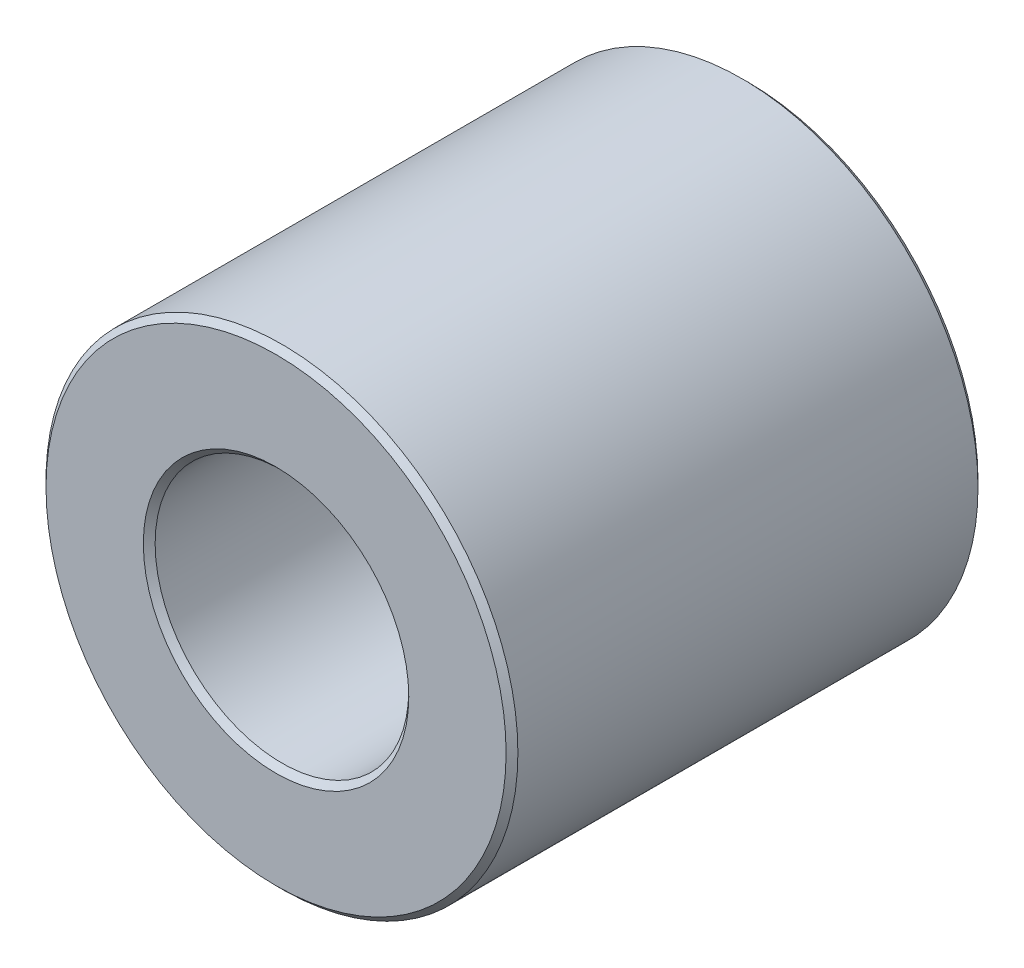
ISO-10303-21;
HEADER;
FILE_DESCRIPTION(('STEP AP214'),'2;1');
FILE_NAME('part.step','',(''),(''),'','','');
FILE_SCHEMA(('AUTOMOTIVE_DESIGN { 1 0 10303 214 1 1 1 1 }'));
ENDSEC;
DATA;
#1=APPLICATION_CONTEXT('core data for automotive mechanical design processes');
#2=APPLICATION_PROTOCOL_DEFINITION('international standard','automotive_design',2000,#1);
#3=PRODUCT_CONTEXT('',#1,'mechanical');
#4=PRODUCT('Part','Part','',(#3));
#5=PRODUCT_RELATED_PRODUCT_CATEGORY('part','',(#4));
#6=PRODUCT_DEFINITION_FORMATION('','',#4);
#7=PRODUCT_DEFINITION_CONTEXT('part definition',#1,'design');
#8=PRODUCT_DEFINITION('design','',#6,#7);
#9=PRODUCT_DEFINITION_SHAPE('','',#8);
#10=(LENGTH_UNIT() NAMED_UNIT(*) SI_UNIT(.MILLI.,.METRE.));
#11=(NAMED_UNIT(*) PLANE_ANGLE_UNIT() SI_UNIT($,.RADIAN.));
#12=(NAMED_UNIT(*) SI_UNIT($,.STERADIAN.) SOLID_ANGLE_UNIT());
#13=UNCERTAINTY_MEASURE_WITH_UNIT(LENGTH_MEASURE(1.E-05),#10,'distance_accuracy_value','');
#14=(GEOMETRIC_REPRESENTATION_CONTEXT(3) GLOBAL_UNCERTAINTY_ASSIGNED_CONTEXT((#13)) GLOBAL_UNIT_ASSIGNED_CONTEXT((#10,
#11,#12)) REPRESENTATION_CONTEXT('',''));
#15=CARTESIAN_POINT('',(0.,0.,0.));
#16=DIRECTION('',(0.,0.,1.));
#17=DIRECTION('',(1.,0.,0.));
#18=AXIS2_PLACEMENT_3D('',#15,#16,#17);
#19=CARTESIAN_POINT('',(0.,0.,4.));
#20=DIRECTION('',(0.,0.,1.));
#21=DIRECTION('',(1.,0.,0.));
#22=AXIS2_PLACEMENT_3D('',#19,#20,#21);
#23=PLANE('',#22);
#24=CARTESIAN_POINT('',(0.,0.,4.));
#25=DIRECTION('',(0.,0.,1.));
#26=DIRECTION('',(1.,0.,0.));
#27=AXIS2_PLACEMENT_3D('',#24,#25,#26);
#28=CIRCLE('',#27,2.25);
#29=CARTESIAN_POINT('',(2.25,0.,4.));
#30=VERTEX_POINT('',#29);
#31=EDGE_CURVE('E10',#30,#30,#28,.F.);
#32=ORIENTED_EDGE('',*,*,#31,.T.);
#33=EDGE_LOOP('',(#32));
#34=FACE_BOUND('',#33,.T.);
#35=CARTESIAN_POINT('',(0.,0.,4.));
#36=DIRECTION('',(0.,0.,1.));
#37=DIRECTION('',(1.,0.,0.));
#38=AXIS2_PLACEMENT_3D('',#35,#36,#37);
#39=CIRCLE('',#38,3.9);
#40=CARTESIAN_POINT('',(3.9,0.,4.));
#41=VERTEX_POINT('',#40);
#42=EDGE_CURVE('E45',#41,#41,#39,.T.);
#43=ORIENTED_EDGE('',*,*,#42,.T.);
#44=EDGE_LOOP('',(#43));
#45=FACE_BOUND('',#44,.T.);
#46=ADVANCED_FACE('F37',(#34,#45),#23,.T.);
#47=CARTESIAN_POINT('',(0.,0.,-4.));
#48=DIRECTION('',(0.,0.,1.));
#49=DIRECTION('',(1.,0.,0.));
#50=AXIS2_PLACEMENT_3D('',#47,#48,#49);
#51=PLANE('',#50);
#52=CARTESIAN_POINT('',(0.,0.,-4.));
#53=DIRECTION('',(0.,0.,1.));
#54=DIRECTION('',(1.,0.,0.));
#55=AXIS2_PLACEMENT_3D('',#52,#53,#54);
#56=CIRCLE('',#55,3.9);
#57=CARTESIAN_POINT('',(3.9,0.,-4.));
#58=VERTEX_POINT('',#57);
#59=EDGE_CURVE('E63',#58,#58,#56,.F.);
#60=ORIENTED_EDGE('',*,*,#59,.T.);
#61=EDGE_LOOP('',(#60));
#62=FACE_BOUND('',#61,.T.);
#63=CARTESIAN_POINT('',(0.,0.,-4.));
#64=DIRECTION('',(0.,0.,1.));
#65=DIRECTION('',(1.,0.,0.));
#66=AXIS2_PLACEMENT_3D('',#63,#64,#65);
#67=CIRCLE('',#66,2.25);
#68=CARTESIAN_POINT('',(2.25,0.,-4.));
#69=VERTEX_POINT('',#68);
#70=EDGE_CURVE('E66',#69,#69,#67,.T.);
#71=ORIENTED_EDGE('',*,*,#70,.T.);
#72=EDGE_LOOP('',(#71));
#73=FACE_BOUND('',#72,.T.);
#74=ADVANCED_FACE('F89',(#62,#73),#51,.F.);
#75=CARTESIAN_POINT('',(0.,0.,4.));
#76=DIRECTION('',(0.,0.,-1.));
#77=DIRECTION('',(-1.,0.,0.));
#78=AXIS2_PLACEMENT_3D('',#75,#76,#77);
#79=CYLINDRICAL_SURFACE('',#78,4.);
#80=CARTESIAN_POINT('',(0.,0.,-3.9));
#81=DIRECTION('',(0.,0.,1.));
#82=DIRECTION('',(1.,0.,0.));
#83=AXIS2_PLACEMENT_3D('',#80,#81,#82);
#84=CIRCLE('',#83,4.);
#85=CARTESIAN_POINT('',(4.,0.,-3.9));
#86=VERTEX_POINT('',#85);
#87=EDGE_CURVE('E70',#86,#86,#84,.T.);
#88=ORIENTED_EDGE('',*,*,#87,.T.);
#89=EDGE_LOOP('',(#88));
#90=FACE_BOUND('',#89,.T.);
#91=CARTESIAN_POINT('',(0.,0.,3.9));
#92=DIRECTION('',(0.,0.,1.));
#93=DIRECTION('',(1.,0.,0.));
#94=AXIS2_PLACEMENT_3D('',#91,#92,#93);
#95=CIRCLE('',#94,4.);
#96=CARTESIAN_POINT('',(4.,0.,3.9));
#97=VERTEX_POINT('',#96);
#98=EDGE_CURVE('E73',#97,#97,#95,.F.);
#99=ORIENTED_EDGE('',*,*,#98,.T.);
#100=EDGE_LOOP('',(#99));
#101=FACE_BOUND('',#100,.T.);
#102=ADVANCED_FACE('F78',(#90,#101),#79,.T.);
#103=CARTESIAN_POINT('',(0.,0.,4.));
#104=DIRECTION('',(0.,0.,-1.));
#105=DIRECTION('',(-1.,0.,0.));
#106=AXIS2_PLACEMENT_3D('',#103,#104,#105);
#107=CYLINDRICAL_SURFACE('',#106,2.15);
#108=CARTESIAN_POINT('',(0.,0.,-3.9));
#109=DIRECTION('',(0.,0.,1.));
#110=DIRECTION('',(1.,0.,0.));
#111=AXIS2_PLACEMENT_3D('',#108,#109,#110);
#112=CIRCLE('',#111,2.15);
#113=CARTESIAN_POINT('',(2.15,0.,-3.9));
#114=VERTEX_POINT('',#113);
#115=EDGE_CURVE('E51',#114,#114,#112,.F.);
#116=ORIENTED_EDGE('',*,*,#115,.T.);
#117=EDGE_LOOP('',(#116));
#118=FACE_BOUND('',#117,.T.);
#119=CARTESIAN_POINT('',(0.,0.,3.9));
#120=DIRECTION('',(0.,0.,1.));
#121=DIRECTION('',(1.,0.,0.));
#122=AXIS2_PLACEMENT_3D('',#119,#120,#121);
#123=CIRCLE('',#122,2.15);
#124=CARTESIAN_POINT('',(2.15,0.,3.9));
#125=VERTEX_POINT('',#124);
#126=EDGE_CURVE('E57',#125,#125,#123,.T.);
#127=ORIENTED_EDGE('',*,*,#126,.T.);
#128=EDGE_LOOP('',(#127));
#129=FACE_BOUND('',#128,.T.);
#130=ADVANCED_FACE('F97',(#118,#129),#107,.F.);
#131=CARTESIAN_POINT('',(0.,0.,-3.9));
#132=DIRECTION('',(0.,0.,1.));
#133=DIRECTION('',(1.,0.,0.));
#134=AXIS2_PLACEMENT_3D('',#131,#132,#133);
#135=CONICAL_SURFACE('',#134,4.,0.785398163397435);
#136=ORIENTED_EDGE('',*,*,#59,.F.);
#137=EDGE_LOOP('',(#136));
#138=FACE_BOUND('',#137,.T.);
#139=ORIENTED_EDGE('',*,*,#87,.F.);
#140=EDGE_LOOP('',(#139));
#141=FACE_BOUND('',#140,.T.);
#142=ADVANCED_FACE('F102',(#138,#141),#135,.T.);
#143=CARTESIAN_POINT('',(0.,0.,-4.));
#144=DIRECTION('',(0.,0.,-1.));
#145=DIRECTION('',(-1.,0.,0.));
#146=AXIS2_PLACEMENT_3D('',#143,#144,#145);
#147=CONICAL_SURFACE('',#146,2.25,0.785398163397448);
#148=ORIENTED_EDGE('',*,*,#115,.F.);
#149=EDGE_LOOP('',(#148));
#150=FACE_BOUND('',#149,.T.);
#151=ORIENTED_EDGE('',*,*,#70,.F.);
#152=EDGE_LOOP('',(#151));
#153=FACE_BOUND('',#152,.T.);
#154=ADVANCED_FACE('F86',(#150,#153),#147,.F.);
#155=CARTESIAN_POINT('',(0.,0.,3.9));
#156=DIRECTION('',(0.,0.,1.));
#157=DIRECTION('',(1.,0.,0.));
#158=AXIS2_PLACEMENT_3D('',#155,#156,#157);
#159=CONICAL_SURFACE('',#158,2.15,0.78539816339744);
#160=ORIENTED_EDGE('',*,*,#31,.F.);
#161=EDGE_LOOP('',(#160));
#162=FACE_BOUND('',#161,.T.);
#163=ORIENTED_EDGE('',*,*,#126,.F.);
#164=EDGE_LOOP('',(#163));
#165=FACE_BOUND('',#164,.T.);
#166=ADVANCED_FACE('F82',(#162,#165),#159,.F.);
#167=CARTESIAN_POINT('',(0.,0.,4.));
#168=DIRECTION('',(0.,0.,-1.));
#169=DIRECTION('',(-1.,0.,0.));
#170=AXIS2_PLACEMENT_3D('',#167,#168,#169);
#171=CONICAL_SURFACE('',#170,3.9,0.785398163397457);
#172=ORIENTED_EDGE('',*,*,#98,.F.);
#173=EDGE_LOOP('',(#172));
#174=FACE_BOUND('',#173,.T.);
#175=ORIENTED_EDGE('',*,*,#42,.F.);
#176=EDGE_LOOP('',(#175));
#177=FACE_BOUND('',#176,.T.);
#178=ADVANCED_FACE('F39',(#174,#177),#171,.T.);
#179=CLOSED_SHELL('',(#46,#74,#102,#130,#142,#154,#166,#178));
#180=MANIFOLD_SOLID_BREP('B2',#179);
#181=ADVANCED_BREP_SHAPE_REPRESENTATION('',(#18,#180),#14);
#182=SHAPE_DEFINITION_REPRESENTATION(#9,#181);
ENDSEC;
END-ISO-10303-21;
